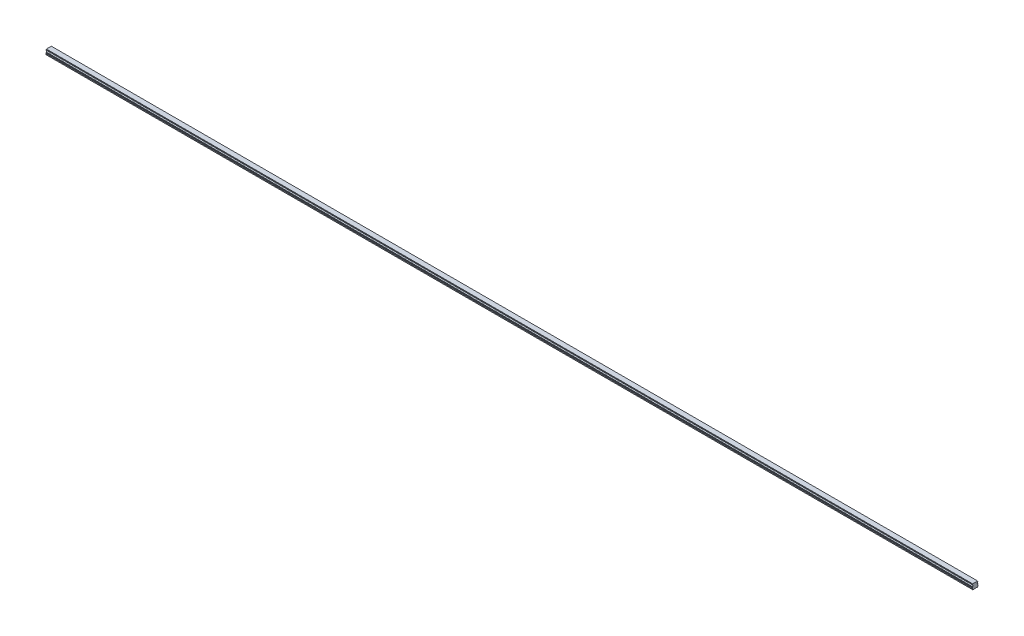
from build123d import *

# Parameters (mm, degrees)
BOSS_EXTRUDE1_DEPTH        = 2460
SKETCH3_R                  = 2.5
SKETCH3_R_2                = 2.1
CUT_EXTRUDE3_DEPTH         = 7
SKETCH3_2_R                = 2.1
CUT_EXTRUDE4_DEPTH         = 9.5
CHAMFER1_SIZE              = 0.4
LPATTERN2_COUNT            = 41
LPATTERN2_PITCH            = 60
CHAMFER1_OF_LPATTERN2_SIZE = 0.4


with BuildPart() as part:
    # Sketch1 → Boss-Extrude1 (new body)
    with BuildSketch(Plane(origin=(0, 0, 0), x_dir=(0, 0, -1), z_dir=(1, 0, 0))):
        with BuildLine():
            Line((6.59, 14), (-6.59, 14))
            Line((-6.59, 14), (-6.59, 13.15))
            Line((-6.59, 13.15), (-6.96, 12.356532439))
            Line((-6.96, 12.356532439), (-6.96, 11.435174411))
            ThreePointArc((-6.96, 11.435174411), (-5.25, 9.5), (-6.96, 7.564825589))
            Line((-6.96, 7.564825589), (-6.96, 6.643467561))
            Line((-6.96, 6.643467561), (-6.59, 5.85))
            Line((-6.59, 5.85), (-7.032116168, 4.2))
            Line((-7.032116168, 4.2), (-7.5, 3.929867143))
            Line((-7.5, 3.929867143), (-7.5, 1.4))
            Line((-7.5, 1.4), (-6.1, 0))
            Line((-6.1, 0), (-3.65, 0))
            Line((-3.65, 0), (-3.25, 0.4))
            Line((-3.25, 0.4), (3.25, 0.4))
            Line((3.25, 0.4), (3.65, 0))
            Line((3.65, 0), (6.1, 0))
            Line((6.1, 0), (7.5, 1.4))
            Line((7.5, 1.4), (7.5, 3.929867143))
            Line((7.5, 3.929867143), (7.032116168, 4.2))
            Line((7.032116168, 4.2), (6.59, 5.85))
            Line((6.59, 5.85), (6.96, 6.643467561))
            Line((6.96, 6.643467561), (6.96, 7.564825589))
            ThreePointArc((6.96, 7.564825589), (5.25, 9.5), (6.96, 11.435174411))
            Line((6.96, 11.435174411), (6.96, 12.356532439))
            Line((6.96, 12.356532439), (6.59, 13.15))
            Line((6.59, 13.15), (6.59, 14))
        make_face()
    extrude(amount=BOSS_EXTRUDE1_DEPTH)

    # Sketch3 → Cut-Extrude3 (cut)
    with BuildSketch(Plane.XZ):
        with Locations(Location((30, 0, 0), (0, 0, 270))):
            Circle(SKETCH3_R)
        with Locations(Location((30, 0, 0), (0, 0, 270))):
            Circle(SKETCH3_R_2, mode=Mode.SUBTRACT)
    cut_extrude3 = extrude(amount=-CUT_EXTRUDE3_DEPTH, mode=Mode.SUBTRACT)

    # Sketch3_2 → Cut-Extrude4 (cut)
    with BuildSketch(Plane.XZ):
        with Locations(Location((30, 0, 0), (0, 0, 270))):
            Circle(SKETCH3_2_R)
    cut_extrude4 = extrude(amount=-CUT_EXTRUDE4_DEPTH, mode=Mode.SUBTRACT)

    # Cut-Extrude5 cone 1 section (on through the dimple's axis) → Cut-Extrude5 (revolve, cut)
    with BuildSketch(Plane(origin=(30, 9.5, 0), x_dir=(0, 0, -1), z_dir=(1, 0, 0))):
        Polygon((0, 0), (2.1, 0), (0, 1.212435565), align=None)
    revolve(axis=Axis((30, 9.5, 0), (0, 1, 0)), mode=Mode.SUBTRACT)

    # Chamfer1
    chamfer1_edges = [part.edges().sort_by_distance(p)[0] for p in [
        (30, 0.4, 2.5),
    ]]
    chamfer(chamfer1_edges, length=CHAMFER1_SIZE)

    # LPattern2: Cut-Extrude3, Cut-Extrude4 ×41
    with Locations(*[(i * LPATTERN2_PITCH, 0, 0) for i in range(1, LPATTERN2_COUNT)]):
        add(cut_extrude3, mode=Mode.SUBTRACT)
        add(cut_extrude4, mode=Mode.SUBTRACT)

    # Chamfer1 of LPattern2
    chamfer1_of_lpattern2_edges = [part.edges().sort_by_distance(p)[0] for p in [
        (90, 0.4, 2.5),
        (150, 0.4, 2.5),
        (210, 0.4, 2.5),
        (270, 0.4, 2.5),
        (330, 0.4, 2.5),
        (390, 0.4, 2.5),
        (450, 0.4, 2.5),
        (510, 0.4, 2.5),
        (570, 0.4, 2.5),
        (630, 0.4, 2.5),
        (690, 0.4, 2.5),
        (750, 0.4, 2.5),
        (810, 0.4, 2.5),
        (870, 0.4, 2.5),
        (930, 0.4, 2.5),
        (990, 0.4, 2.5),
        (1050, 0.4, 2.5),
        (1110, 0.4, 2.5),
        (1170, 0.4, 2.5),
        (1230, 0.4, 2.5),
        (1290, 0.4, 2.5),
        (1350, 0.4, 2.5),
        (1410, 0.4, 2.5),
        (1470, 0.4, 2.5),
        (1530, 0.4, 2.5),
        (1590, 0.4, 2.5),
        (1650, 0.4, 2.5),
        (1710, 0.4, 2.5),
        (1770, 0.4, 2.5),
        (1830, 0.4, 2.5),
        (1890, 0.4, 2.5),
        (1950, 0.4, 2.5),
        (2010, 0.4, 2.5),
        (2070, 0.4, 2.5),
        (2130, 0.4, 2.5),
        (2190, 0.4, 2.5),
        (2250, 0.4, 2.5),
        (2310, 0.4, 2.5),
        (2370, 0.4, 2.5),
        (2430, 0.4, 2.5),
    ]]
    chamfer(chamfer1_of_lpattern2_edges, length=CHAMFER1_OF_LPATTERN2_SIZE)


solid = part.part
